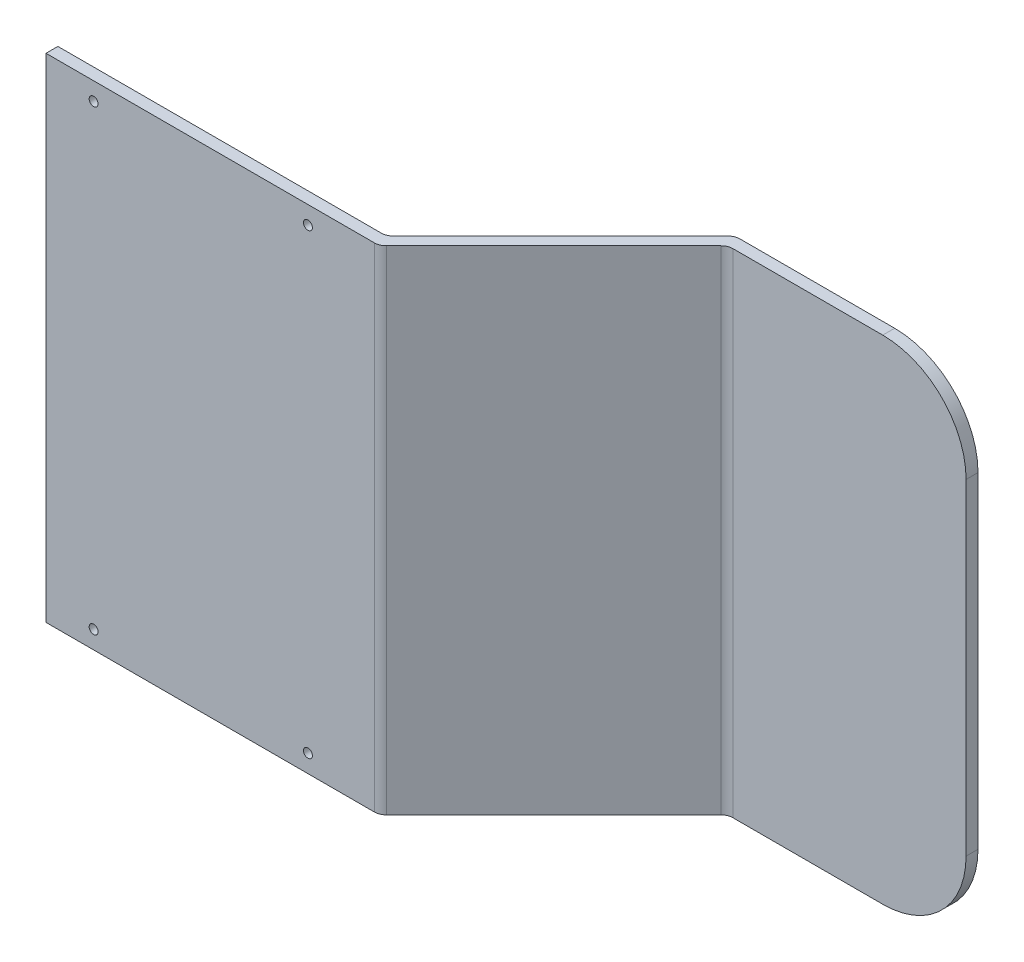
ISO-10303-21;
HEADER;
FILE_DESCRIPTION(('STEP AP214'),'2;1');
FILE_NAME('part.step','',(''),(''),'','','');
FILE_SCHEMA(('AUTOMOTIVE_DESIGN { 1 0 10303 214 1 1 1 1 }'));
ENDSEC;
DATA;
#1=APPLICATION_CONTEXT('core data for automotive mechanical design processes');
#2=APPLICATION_PROTOCOL_DEFINITION('international standard','automotive_design',2000,#1);
#3=PRODUCT_CONTEXT('',#1,'mechanical');
#4=PRODUCT('Part','Part','',(#3));
#5=PRODUCT_RELATED_PRODUCT_CATEGORY('part','',(#4));
#6=PRODUCT_DEFINITION_FORMATION('','',#4);
#7=PRODUCT_DEFINITION_CONTEXT('part definition',#1,'design');
#8=PRODUCT_DEFINITION('design','',#6,#7);
#9=PRODUCT_DEFINITION_SHAPE('','',#8);
#10=(LENGTH_UNIT() NAMED_UNIT(*) SI_UNIT(.MILLI.,.METRE.));
#11=(NAMED_UNIT(*) PLANE_ANGLE_UNIT() SI_UNIT($,.RADIAN.));
#12=(NAMED_UNIT(*) SI_UNIT($,.STERADIAN.) SOLID_ANGLE_UNIT());
#13=UNCERTAINTY_MEASURE_WITH_UNIT(LENGTH_MEASURE(1.E-05),#10,'distance_accuracy_value','');
#14=(GEOMETRIC_REPRESENTATION_CONTEXT(3) GLOBAL_UNCERTAINTY_ASSIGNED_CONTEXT((#13)) GLOBAL_UNIT_ASSIGNED_CONTEXT((#10,
#11,#12)) REPRESENTATION_CONTEXT('',''));
#15=CARTESIAN_POINT('',(0.,0.,0.));
#16=DIRECTION('',(0.,0.,1.));
#17=DIRECTION('',(1.,0.,0.));
#18=AXIS2_PLACEMENT_3D('',#15,#16,#17);
#19=CARTESIAN_POINT('',(0.,-525.78,0.));
#20=DIRECTION('',(-1.,0.,0.));
#21=DIRECTION('',(0.,0.,1.));
#22=AXIS2_PLACEMENT_3D('',#19,#20,#21);
#23=PLANE('',#22);
#24=DIRECTION('',(0.,0.,1.));
#25=VECTOR('',#24,1.);
#26=CARTESIAN_POINT('',(0.,0.,0.));
#27=LINE('',#26,#25);
#28=CARTESIAN_POINT('',(0.,0.,-12.7));
#29=VERTEX_POINT('',#28);
#30=CARTESIAN_POINT('',(0.,0.,0.));
#31=VERTEX_POINT('',#30);
#32=EDGE_CURVE('E180',#29,#31,#27,.T.);
#33=ORIENTED_EDGE('',*,*,#32,.F.);
#34=DIRECTION('',(0.,1.,0.));
#35=VECTOR('',#34,1.);
#36=CARTESIAN_POINT('',(0.,-525.78,-12.7));
#37=LINE('',#36,#35);
#38=CARTESIAN_POINT('',(0.,-525.78,-12.7));
#39=VERTEX_POINT('',#38);
#40=EDGE_CURVE('E161',#39,#29,#37,.T.);
#41=ORIENTED_EDGE('',*,*,#40,.F.);
#42=DIRECTION('',(0.,0.,1.));
#43=VECTOR('',#42,1.);
#44=CARTESIAN_POINT('',(0.,-525.78,0.));
#45=LINE('',#44,#43);
#46=CARTESIAN_POINT('',(0.,-525.78,0.));
#47=VERTEX_POINT('',#46);
#48=EDGE_CURVE('E153',#39,#47,#45,.T.);
#49=ORIENTED_EDGE('',*,*,#48,.T.);
#50=DIRECTION('',(0.,1.,0.));
#51=VECTOR('',#50,1.);
#52=CARTESIAN_POINT('',(0.,-525.78,0.));
#53=LINE('',#52,#51);
#54=EDGE_CURVE('E135',#47,#31,#53,.T.);
#55=ORIENTED_EDGE('',*,*,#54,.T.);
#56=EDGE_LOOP('',(#33,#41,#49,#55));
#57=FACE_BOUND('',#56,.T.);
#58=ADVANCED_FACE('F30',(#57),#23,.T.);
#59=CARTESIAN_POINT('',(350.339487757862,-525.78,-12.7));
#60=DIRECTION('',(0.,0.,-1.));
#61=DIRECTION('',(-1.,0.,0.));
#62=AXIS2_PLACEMENT_3D('',#59,#60,#61);
#63=PLANE('',#62);
#64=CARTESIAN_POINT('',(50.8,-506.73,-12.7));
#65=DIRECTION('',(0.,0.,-1.));
#66=DIRECTION('',(-1.,0.,0.));
#67=AXIS2_PLACEMENT_3D('',#64,#65,#66);
#68=CIRCLE('',#67,4.76249999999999);
#69=CARTESIAN_POINT('',(46.0375,-506.73,-12.7));
#70=VERTEX_POINT('',#69);
#71=EDGE_CURVE('E362',#70,#70,#68,.T.);
#72=ORIENTED_EDGE('',*,*,#71,.F.);
#73=EDGE_LOOP('',(#72));
#74=FACE_BOUND('',#73,.T.);
#75=CARTESIAN_POINT('',(279.4,-506.73,-12.7));
#76=DIRECTION('',(0.,0.,-1.));
#77=DIRECTION('',(-1.,0.,0.));
#78=AXIS2_PLACEMENT_3D('',#75,#76,#77);
#79=CIRCLE('',#78,4.76250000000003);
#80=CARTESIAN_POINT('',(274.6375,-506.73,-12.7));
#81=VERTEX_POINT('',#80);
#82=EDGE_CURVE('E358',#81,#81,#79,.T.);
#83=ORIENTED_EDGE('',*,*,#82,.F.);
#84=EDGE_LOOP('',(#83));
#85=FACE_BOUND('',#84,.T.);
#86=CARTESIAN_POINT('',(279.4,-19.05,-12.7));
#87=DIRECTION('',(0.,0.,-1.));
#88=DIRECTION('',(-1.,0.,0.));
#89=AXIS2_PLACEMENT_3D('',#86,#87,#88);
#90=CIRCLE('',#89,4.76250000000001);
#91=CARTESIAN_POINT('',(274.6375,-19.05,-12.7));
#92=VERTEX_POINT('',#91);
#93=EDGE_CURVE('E352',#92,#92,#90,.T.);
#94=ORIENTED_EDGE('',*,*,#93,.F.);
#95=EDGE_LOOP('',(#94));
#96=FACE_BOUND('',#95,.T.);
#97=CARTESIAN_POINT('',(50.8,-19.05,-12.7));
#98=DIRECTION('',(0.,0.,-1.));
#99=DIRECTION('',(-1.,0.,0.));
#100=AXIS2_PLACEMENT_3D('',#97,#98,#99);
#101=CIRCLE('',#100,4.7625);
#102=CARTESIAN_POINT('',(46.0375,-19.05,-12.7));
#103=VERTEX_POINT('',#102);
#104=EDGE_CURVE('E167',#103,#103,#101,.T.);
#105=ORIENTED_EDGE('',*,*,#104,.F.);
#106=EDGE_LOOP('',(#105));
#107=FACE_BOUND('',#106,.T.);
#108=DIRECTION('',(-1.,0.,0.));
#109=VECTOR('',#108,1.);
#110=CARTESIAN_POINT('',(350.339487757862,0.,-12.7));
#111=LINE('',#110,#109);
#112=CARTESIAN_POINT('',(345.078975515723,0.,-12.7));
#113=VERTEX_POINT('',#112);
#114=EDGE_CURVE('E162',#113,#29,#111,.T.);
#115=ORIENTED_EDGE('',*,*,#114,.F.);
#116=DIRECTION('',(0.,1.,0.));
#117=VECTOR('',#116,1.);
#118=CARTESIAN_POINT('',(345.078975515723,-525.78,-12.7));
#119=LINE('',#118,#117);
#120=CARTESIAN_POINT('',(345.078975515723,-525.78,-12.7));
#121=VERTEX_POINT('',#120);
#122=EDGE_CURVE('E213',#113,#121,#119,.F.);
#123=ORIENTED_EDGE('',*,*,#122,.T.);
#124=DIRECTION('',(-1.,0.,0.));
#125=VECTOR('',#124,1.);
#126=CARTESIAN_POINT('',(350.339487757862,-525.78,-12.7));
#127=LINE('',#126,#125);
#128=EDGE_CURVE('E148',#121,#39,#127,.T.);
#129=ORIENTED_EDGE('',*,*,#128,.T.);
#130=ORIENTED_EDGE('',*,*,#40,.T.);
#131=EDGE_LOOP('',(#115,#123,#129,#130));
#132=FACE_BOUND('',#131,.T.);
#133=ADVANCED_FACE('F278',(#74,#85,#96,#107,#132),#63,.T.);
#134=CARTESIAN_POINT('',(536.267487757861,-525.78,-198.628));
#135=DIRECTION('',(-0.707106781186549,0.,-0.707106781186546));
#136=DIRECTION('',(-0.707106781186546,0.,0.707106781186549));
#137=AXIS2_PLACEMENT_3D('',#134,#135,#136);
#138=PLANE('',#137);
#139=DIRECTION('',(-0.707106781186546,0.,0.707106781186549));
#140=VECTOR('',#139,1.);
#141=CARTESIAN_POINT('',(536.267487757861,0.,-198.628));
#142=LINE('',#141,#140);
#143=CARTESIAN_POINT('',(532.54774387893,0.,-194.908256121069));
#144=VERTEX_POINT('',#143);
#145=CARTESIAN_POINT('',(354.059231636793,0.,-16.4197438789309));
#146=VERTEX_POINT('',#145);
#147=EDGE_CURVE('E164',#144,#146,#142,.T.);
#148=ORIENTED_EDGE('',*,*,#147,.F.);
#149=DIRECTION('',(0.,1.,0.));
#150=VECTOR('',#149,1.);
#151=CARTESIAN_POINT('',(532.54774387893,-525.78,-194.908256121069));
#152=LINE('',#151,#150);
#153=CARTESIAN_POINT('',(532.54774387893,-525.78,-194.908256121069));
#154=VERTEX_POINT('',#153);
#155=EDGE_CURVE('E207',#144,#154,#152,.F.);
#156=ORIENTED_EDGE('',*,*,#155,.T.);
#157=DIRECTION('',(-0.707106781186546,0.,0.707106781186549));
#158=VECTOR('',#157,1.);
#159=CARTESIAN_POINT('',(536.267487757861,-525.78,-198.628));
#160=LINE('',#159,#158);
#161=CARTESIAN_POINT('',(354.059231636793,-525.78,-16.4197438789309));
#162=VERTEX_POINT('',#161);
#163=EDGE_CURVE('E176',#154,#162,#160,.T.);
#164=ORIENTED_EDGE('',*,*,#163,.T.);
#165=DIRECTION('',(0.,1.,0.));
#166=VECTOR('',#165,1.);
#167=CARTESIAN_POINT('',(354.059231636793,0.,-16.4197438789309));
#168=LINE('',#167,#166);
#169=EDGE_CURVE('E204',#162,#146,#168,.T.);
#170=ORIENTED_EDGE('',*,*,#169,.T.);
#171=EDGE_LOOP('',(#148,#156,#164,#170));
#172=FACE_BOUND('',#171,.T.);
#173=ADVANCED_FACE('F283',(#172),#138,.T.);
#174=CARTESIAN_POINT('',(795.527999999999,-525.78,-198.628));
#175=DIRECTION('',(0.,0.,-1.));
#176=DIRECTION('',(-1.,0.,0.));
#177=AXIS2_PLACEMENT_3D('',#174,#175,#176);
#178=PLANE('',#177);
#179=DIRECTION('',(0.,1.,0.));
#180=VECTOR('',#179,1.);
#181=CARTESIAN_POINT('',(795.527999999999,-525.78,-198.628));
#182=LINE('',#181,#180);
#183=CARTESIAN_POINT('',(795.527999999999,-436.88,-198.628));
#184=VERTEX_POINT('',#183);
#185=CARTESIAN_POINT('',(795.527999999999,-88.9,-198.628));
#186=VERTEX_POINT('',#185);
#187=EDGE_CURVE('E194',#184,#186,#182,.T.);
#188=ORIENTED_EDGE('',*,*,#187,.F.);
#189=CARTESIAN_POINT('',(706.627999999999,-436.88,-198.628));
#190=DIRECTION('',(0.,0.,-1.));
#191=DIRECTION('',(-1.,0.,0.));
#192=AXIS2_PLACEMENT_3D('',#189,#190,#191);
#193=CIRCLE('',#192,88.9);
#194=CARTESIAN_POINT('',(706.627999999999,-525.78,-198.628));
#195=VERTEX_POINT('',#194);
#196=EDGE_CURVE('E239',#184,#195,#193,.T.);
#197=ORIENTED_EDGE('',*,*,#196,.T.);
#198=DIRECTION('',(-1.,0.,0.));
#199=VECTOR('',#198,1.);
#200=CARTESIAN_POINT('',(795.527999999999,-525.78,-198.628));
#201=LINE('',#200,#199);
#202=CARTESIAN_POINT('',(541.527999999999,-525.78,-198.628));
#203=VERTEX_POINT('',#202);
#204=EDGE_CURVE('E174',#195,#203,#201,.T.);
#205=ORIENTED_EDGE('',*,*,#204,.T.);
#206=DIRECTION('',(0.,1.,0.));
#207=VECTOR('',#206,1.);
#208=CARTESIAN_POINT('',(541.527999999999,-525.78,-198.628));
#209=LINE('',#208,#207);
#210=CARTESIAN_POINT('',(541.527999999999,0.,-198.628));
#211=VERTEX_POINT('',#210);
#212=EDGE_CURVE('E193',#203,#211,#209,.T.);
#213=ORIENTED_EDGE('',*,*,#212,.T.);
#214=DIRECTION('',(-1.,0.,0.));
#215=VECTOR('',#214,1.);
#216=CARTESIAN_POINT('',(795.527999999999,0.,-198.628));
#217=LINE('',#216,#215);
#218=CARTESIAN_POINT('',(706.627999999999,0.,-198.628));
#219=VERTEX_POINT('',#218);
#220=EDGE_CURVE('E188',#219,#211,#217,.T.);
#221=ORIENTED_EDGE('',*,*,#220,.F.);
#222=CARTESIAN_POINT('',(706.627999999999,-88.9,-198.628));
#223=DIRECTION('',(0.,0.,-1.));
#224=DIRECTION('',(-1.,0.,0.));
#225=AXIS2_PLACEMENT_3D('',#222,#223,#224);
#226=CIRCLE('',#225,88.9);
#227=EDGE_CURVE('E237',#219,#186,#226,.T.);
#228=ORIENTED_EDGE('',*,*,#227,.T.);
#229=EDGE_LOOP('',(#188,#197,#205,#213,#221,#228));
#230=FACE_BOUND('',#229,.T.);
#231=ADVANCED_FACE('F253',(#230),#178,.T.);
#232=CARTESIAN_POINT('',(795.527999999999,-525.78,-185.928));
#233=DIRECTION('',(1.,0.,0.));
#234=DIRECTION('',(0.,0.,-1.));
#235=AXIS2_PLACEMENT_3D('',#232,#233,#234);
#236=PLANE('',#235);
#237=DIRECTION('',(0.,1.,0.));
#238=VECTOR('',#237,1.);
#239=CARTESIAN_POINT('',(795.527999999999,-525.78,-185.928));
#240=LINE('',#239,#238);
#241=CARTESIAN_POINT('',(795.527999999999,-436.88,-185.928));
#242=VERTEX_POINT('',#241);
#243=CARTESIAN_POINT('',(795.527999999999,-88.9,-185.928));
#244=VERTEX_POINT('',#243);
#245=EDGE_CURVE('E147',#242,#244,#240,.T.);
#246=ORIENTED_EDGE('',*,*,#245,.F.);
#247=DIRECTION('',(0.,0.,-1.));
#248=VECTOR('',#247,1.);
#249=CARTESIAN_POINT('',(795.527999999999,-436.88,-198.628));
#250=LINE('',#249,#248);
#251=EDGE_CURVE('E234',#242,#184,#250,.T.);
#252=ORIENTED_EDGE('',*,*,#251,.T.);
#253=ORIENTED_EDGE('',*,*,#187,.T.);
#254=DIRECTION('',(0.,0.,-1.));
#255=VECTOR('',#254,1.);
#256=CARTESIAN_POINT('',(795.527999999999,-88.9,-185.928));
#257=LINE('',#256,#255);
#258=EDGE_CURVE('E232',#186,#244,#257,.F.);
#259=ORIENTED_EDGE('',*,*,#258,.T.);
#260=EDGE_LOOP('',(#246,#252,#253,#259));
#261=FACE_BOUND('',#260,.T.);
#262=ADVANCED_FACE('F248',(#261),#236,.T.);
#263=CARTESIAN_POINT('',(541.527999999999,-525.78,-185.928));
#264=DIRECTION('',(0.,0.,1.));
#265=DIRECTION('',(1.,0.,0.));
#266=AXIS2_PLACEMENT_3D('',#263,#264,#265);
#267=PLANE('',#266);
#268=DIRECTION('',(1.,0.,0.));
#269=VECTOR('',#268,1.);
#270=CARTESIAN_POINT('',(541.527999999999,-525.78,-185.928));
#271=LINE('',#270,#269);
#272=CARTESIAN_POINT('',(546.788512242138,-525.78,-185.928));
#273=VERTEX_POINT('',#272);
#274=CARTESIAN_POINT('',(706.627999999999,-525.78,-185.928));
#275=VERTEX_POINT('',#274);
#276=EDGE_CURVE('E172',#273,#275,#271,.T.);
#277=ORIENTED_EDGE('',*,*,#276,.T.);
#278=CARTESIAN_POINT('',(706.627999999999,-436.88,-185.928));
#279=DIRECTION('',(0.,0.,1.));
#280=DIRECTION('',(1.,0.,0.));
#281=AXIS2_PLACEMENT_3D('',#278,#279,#280);
#282=CIRCLE('',#281,88.9);
#283=EDGE_CURVE('E38',#275,#242,#282,.T.);
#284=ORIENTED_EDGE('',*,*,#283,.T.);
#285=ORIENTED_EDGE('',*,*,#245,.T.);
#286=CARTESIAN_POINT('',(706.627999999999,-88.9,-185.928));
#287=DIRECTION('',(0.,0.,1.));
#288=DIRECTION('',(1.,0.,0.));
#289=AXIS2_PLACEMENT_3D('',#286,#287,#288);
#290=CIRCLE('',#289,88.9);
#291=CARTESIAN_POINT('',(706.627999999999,0.,-185.928));
#292=VERTEX_POINT('',#291);
#293=EDGE_CURVE('E45',#244,#292,#290,.T.);
#294=ORIENTED_EDGE('',*,*,#293,.T.);
#295=DIRECTION('',(1.,0.,0.));
#296=VECTOR('',#295,1.);
#297=CARTESIAN_POINT('',(541.527999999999,0.,-185.928));
#298=LINE('',#297,#296);
#299=CARTESIAN_POINT('',(546.788512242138,0.,-185.928));
#300=VERTEX_POINT('',#299);
#301=EDGE_CURVE('E186',#300,#292,#298,.T.);
#302=ORIENTED_EDGE('',*,*,#301,.F.);
#303=DIRECTION('',(0.,1.,0.));
#304=VECTOR('',#303,1.);
#305=CARTESIAN_POINT('',(546.788512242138,-525.78,-185.928));
#306=LINE('',#305,#304);
#307=EDGE_CURVE('E220',#300,#273,#306,.F.);
#308=ORIENTED_EDGE('',*,*,#307,.T.);
#309=EDGE_LOOP('',(#277,#284,#285,#294,#302,#308));
#310=FACE_BOUND('',#309,.T.);
#311=ADVANCED_FACE('F244',(#310),#267,.T.);
#312=CARTESIAN_POINT('',(355.6,-525.78,0.));
#313=DIRECTION('',(0.707106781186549,0.,0.707106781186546));
#314=DIRECTION('',(0.707106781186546,0.,-0.707106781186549));
#315=AXIS2_PLACEMENT_3D('',#312,#313,#314);
#316=PLANE('',#315);
#317=DIRECTION('',(0.707106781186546,0.,-0.707106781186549));
#318=VECTOR('',#317,1.);
#319=CARTESIAN_POINT('',(355.6,-525.78,0.));
#320=LINE('',#319,#318);
#321=CARTESIAN_POINT('',(359.319743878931,-525.78,-3.71974387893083));
#322=VERTEX_POINT('',#321);
#323=CARTESIAN_POINT('',(537.808256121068,-525.78,-182.208256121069));
#324=VERTEX_POINT('',#323);
#325=EDGE_CURVE('E157',#322,#324,#320,.T.);
#326=ORIENTED_EDGE('',*,*,#325,.T.);
#327=DIRECTION('',(0.,1.,0.));
#328=VECTOR('',#327,1.);
#329=CARTESIAN_POINT('',(537.808256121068,0.,-182.208256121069));
#330=LINE('',#329,#328);
#331=CARTESIAN_POINT('',(537.808256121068,0.,-182.208256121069));
#332=VERTEX_POINT('',#331);
#333=EDGE_CURVE('E217',#324,#332,#330,.T.);
#334=ORIENTED_EDGE('',*,*,#333,.T.);
#335=DIRECTION('',(0.707106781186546,0.,-0.707106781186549));
#336=VECTOR('',#335,1.);
#337=CARTESIAN_POINT('',(355.6,0.,0.));
#338=LINE('',#337,#336);
#339=CARTESIAN_POINT('',(359.319743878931,0.,-3.71974387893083));
#340=VERTEX_POINT('',#339);
#341=EDGE_CURVE('E183',#340,#332,#338,.T.);
#342=ORIENTED_EDGE('',*,*,#341,.F.);
#343=DIRECTION('',(0.,1.,0.));
#344=VECTOR('',#343,1.);
#345=CARTESIAN_POINT('',(359.319743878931,-525.78,-3.71974387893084));
#346=LINE('',#345,#344);
#347=EDGE_CURVE('E215',#340,#322,#346,.F.);
#348=ORIENTED_EDGE('',*,*,#347,.T.);
#349=EDGE_LOOP('',(#326,#334,#342,#348));
#350=FACE_BOUND('',#349,.T.);
#351=ADVANCED_FACE('F322',(#350),#316,.T.);
#352=CARTESIAN_POINT('',(0.,-525.78,0.));
#353=DIRECTION('',(0.,0.,1.));
#354=DIRECTION('',(1.,0.,0.));
#355=AXIS2_PLACEMENT_3D('',#352,#353,#354);
#356=PLANE('',#355);
#357=CARTESIAN_POINT('',(50.8,-506.73,0.));
#358=DIRECTION('',(0.,0.,1.));
#359=DIRECTION('',(-1.,0.,0.));
#360=AXIS2_PLACEMENT_3D('',#357,#358,#359);
#361=CIRCLE('',#360,4.76249999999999);
#362=CARTESIAN_POINT('',(46.0375,-506.73,0.));
#363=VERTEX_POINT('',#362);
#364=EDGE_CURVE('E339',#363,#363,#361,.T.);
#365=ORIENTED_EDGE('',*,*,#364,.F.);
#366=EDGE_LOOP('',(#365));
#367=FACE_BOUND('',#366,.T.);
#368=CARTESIAN_POINT('',(279.4,-506.73,0.));
#369=DIRECTION('',(0.,0.,1.));
#370=DIRECTION('',(-1.,0.,0.));
#371=AXIS2_PLACEMENT_3D('',#368,#369,#370);
#372=CIRCLE('',#371,4.76250000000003);
#373=CARTESIAN_POINT('',(274.6375,-506.73,0.));
#374=VERTEX_POINT('',#373);
#375=EDGE_CURVE('E343',#374,#374,#372,.T.);
#376=ORIENTED_EDGE('',*,*,#375,.F.);
#377=EDGE_LOOP('',(#376));
#378=FACE_BOUND('',#377,.T.);
#379=CARTESIAN_POINT('',(279.4,-19.05,0.));
#380=DIRECTION('',(0.,0.,1.));
#381=DIRECTION('',(1.,0.,0.));
#382=AXIS2_PLACEMENT_3D('',#379,#380,#381);
#383=CIRCLE('',#382,4.76250000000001);
#384=CARTESIAN_POINT('',(284.1625,-19.05,0.));
#385=VERTEX_POINT('',#384);
#386=EDGE_CURVE('E347',#385,#385,#383,.T.);
#387=ORIENTED_EDGE('',*,*,#386,.F.);
#388=EDGE_LOOP('',(#387));
#389=FACE_BOUND('',#388,.T.);
#390=CARTESIAN_POINT('',(50.8,-19.05,0.));
#391=DIRECTION('',(0.,0.,1.));
#392=DIRECTION('',(1.,0.,0.));
#393=AXIS2_PLACEMENT_3D('',#390,#391,#392);
#394=CIRCLE('',#393,4.7625);
#395=CARTESIAN_POINT('',(55.5625,-19.05,0.));
#396=VERTEX_POINT('',#395);
#397=EDGE_CURVE('E350',#396,#396,#394,.T.);
#398=ORIENTED_EDGE('',*,*,#397,.F.);
#399=EDGE_LOOP('',(#398));
#400=FACE_BOUND('',#399,.T.);
#401=DIRECTION('',(1.,0.,0.));
#402=VECTOR('',#401,1.);
#403=CARTESIAN_POINT('',(0.,-525.78,0.));
#404=LINE('',#403,#402);
#405=CARTESIAN_POINT('',(350.339487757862,-525.78,0.));
#406=VERTEX_POINT('',#405);
#407=EDGE_CURVE('E139',#47,#406,#404,.T.);
#408=ORIENTED_EDGE('',*,*,#407,.T.);
#409=DIRECTION('',(0.,1.,0.));
#410=VECTOR('',#409,1.);
#411=CARTESIAN_POINT('',(350.339487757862,-525.78,0.));
#412=LINE('',#411,#410);
#413=CARTESIAN_POINT('',(350.339487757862,0.,0.));
#414=VERTEX_POINT('',#413);
#415=EDGE_CURVE('E222',#406,#414,#412,.T.);
#416=ORIENTED_EDGE('',*,*,#415,.T.);
#417=DIRECTION('',(1.,0.,0.));
#418=VECTOR('',#417,1.);
#419=CARTESIAN_POINT('',(0.,0.,0.));
#420=LINE('',#419,#418);
#421=EDGE_CURVE('E142',#31,#414,#420,.T.);
#422=ORIENTED_EDGE('',*,*,#421,.F.);
#423=ORIENTED_EDGE('',*,*,#54,.F.);
#424=EDGE_LOOP('',(#408,#416,#422,#423));
#425=FACE_BOUND('',#424,.T.);
#426=ADVANCED_FACE('F137',(#367,#378,#389,#400,#425),#356,.T.);
#427=CARTESIAN_POINT('',(0.,-525.78,-12.7));
#428=DIRECTION('',(0.,1.,0.));
#429=DIRECTION('',(0.,0.,1.));
#430=AXIS2_PLACEMENT_3D('',#427,#428,#429);
#431=PLANE('',#430);
#432=ORIENTED_EDGE('',*,*,#204,.F.);
#433=DIRECTION('',(0.,0.,-1.));
#434=VECTOR('',#433,1.);
#435=CARTESIAN_POINT('',(706.627999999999,-525.78,-185.928));
#436=LINE('',#435,#434);
#437=EDGE_CURVE('E53',#195,#275,#436,.F.);
#438=ORIENTED_EDGE('',*,*,#437,.T.);
#439=ORIENTED_EDGE('',*,*,#276,.F.);
#440=CARTESIAN_POINT('',(546.788512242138,-525.78,-173.228));
#441=DIRECTION('',(0.,1.,0.));
#442=DIRECTION('',(0.,0.,1.));
#443=AXIS2_PLACEMENT_3D('',#440,#441,#442);
#444=CIRCLE('',#443,12.7);
#445=EDGE_CURVE('E230',#273,#324,#444,.T.);
#446=ORIENTED_EDGE('',*,*,#445,.T.);
#447=ORIENTED_EDGE('',*,*,#325,.F.);
#448=CARTESIAN_POINT('',(350.339487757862,-525.78,-12.7));
#449=DIRECTION('',(0.,1.,0.));
#450=DIRECTION('',(0.,0.,1.));
#451=AXIS2_PLACEMENT_3D('',#448,#449,#450);
#452=CIRCLE('',#451,12.7);
#453=EDGE_CURVE('E156',#322,#406,#452,.F.);
#454=ORIENTED_EDGE('',*,*,#453,.T.);
#455=ORIENTED_EDGE('',*,*,#407,.F.);
#456=ORIENTED_EDGE('',*,*,#48,.F.);
#457=ORIENTED_EDGE('',*,*,#128,.F.);
#458=CARTESIAN_POINT('',(345.078975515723,-525.78,-25.4));
#459=DIRECTION('',(0.,1.,0.));
#460=DIRECTION('',(0.,0.,1.));
#461=AXIS2_PLACEMENT_3D('',#458,#459,#460);
#462=CIRCLE('',#461,12.7);
#463=EDGE_CURVE('E226',#121,#162,#462,.T.);
#464=ORIENTED_EDGE('',*,*,#463,.T.);
#465=ORIENTED_EDGE('',*,*,#163,.F.);
#466=CARTESIAN_POINT('',(541.527999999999,-525.78,-185.928));
#467=DIRECTION('',(0.,1.,0.));
#468=DIRECTION('',(0.,0.,1.));
#469=AXIS2_PLACEMENT_3D('',#466,#467,#468);
#470=CIRCLE('',#469,12.7);
#471=EDGE_CURVE('E210',#154,#203,#470,.F.);
#472=ORIENTED_EDGE('',*,*,#471,.T.);
#473=EDGE_LOOP('',(#432,#438,#439,#446,#447,#454,#455,#456,#457,#464,#465,#472));
#474=FACE_BOUND('',#473,.T.);
#475=ADVANCED_FACE('F151',(#474),#431,.F.);
#476=CARTESIAN_POINT('',(0.,0.,-12.7));
#477=DIRECTION('',(0.,1.,0.));
#478=DIRECTION('',(0.,0.,1.));
#479=AXIS2_PLACEMENT_3D('',#476,#477,#478);
#480=PLANE('',#479);
#481=ORIENTED_EDGE('',*,*,#301,.T.);
#482=DIRECTION('',(0.,0.,-1.));
#483=VECTOR('',#482,1.);
#484=CARTESIAN_POINT('',(706.627999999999,0.,-12.7));
#485=LINE('',#484,#483);
#486=EDGE_CURVE('E11',#292,#219,#485,.T.);
#487=ORIENTED_EDGE('',*,*,#486,.T.);
#488=ORIENTED_EDGE('',*,*,#220,.T.);
#489=CARTESIAN_POINT('',(541.527999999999,0.,-185.928));
#490=DIRECTION('',(0.,1.,0.));
#491=DIRECTION('',(0.,0.,1.));
#492=AXIS2_PLACEMENT_3D('',#489,#490,#491);
#493=CIRCLE('',#492,12.7);
#494=EDGE_CURVE('E202',#211,#144,#493,.T.);
#495=ORIENTED_EDGE('',*,*,#494,.T.);
#496=ORIENTED_EDGE('',*,*,#147,.T.);
#497=CARTESIAN_POINT('',(345.078975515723,0.,-25.4));
#498=DIRECTION('',(0.,1.,0.));
#499=DIRECTION('',(0.,0.,1.));
#500=AXIS2_PLACEMENT_3D('',#497,#498,#499);
#501=CIRCLE('',#500,12.7);
#502=EDGE_CURVE('E224',#146,#113,#501,.F.);
#503=ORIENTED_EDGE('',*,*,#502,.T.);
#504=ORIENTED_EDGE('',*,*,#114,.T.);
#505=ORIENTED_EDGE('',*,*,#32,.T.);
#506=ORIENTED_EDGE('',*,*,#421,.T.);
#507=CARTESIAN_POINT('',(350.339487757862,0.,-12.7));
#508=DIRECTION('',(0.,1.,0.));
#509=DIRECTION('',(0.,0.,1.));
#510=AXIS2_PLACEMENT_3D('',#507,#508,#509);
#511=CIRCLE('',#510,12.7);
#512=EDGE_CURVE('E200',#414,#340,#511,.T.);
#513=ORIENTED_EDGE('',*,*,#512,.T.);
#514=ORIENTED_EDGE('',*,*,#341,.T.);
#515=CARTESIAN_POINT('',(546.788512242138,0.,-173.228));
#516=DIRECTION('',(0.,1.,0.));
#517=DIRECTION('',(0.,0.,1.));
#518=AXIS2_PLACEMENT_3D('',#515,#516,#517);
#519=CIRCLE('',#518,12.7);
#520=EDGE_CURVE('E228',#332,#300,#519,.F.);
#521=ORIENTED_EDGE('',*,*,#520,.T.);
#522=EDGE_LOOP('',(#481,#487,#488,#495,#496,#503,#504,#505,#506,#513,#514,#521));
#523=FACE_BOUND('',#522,.T.);
#524=ADVANCED_FACE('F263',(#523),#480,.T.);
#525=CARTESIAN_POINT('',(541.527999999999,-525.78,-185.928));
#526=DIRECTION('',(0.,1.,0.));
#527=DIRECTION('',(0.,0.,1.));
#528=AXIS2_PLACEMENT_3D('',#525,#526,#527);
#529=CYLINDRICAL_SURFACE('',#528,12.7);
#530=ORIENTED_EDGE('',*,*,#471,.F.);
#531=ORIENTED_EDGE('',*,*,#155,.F.);
#532=ORIENTED_EDGE('',*,*,#494,.F.);
#533=ORIENTED_EDGE('',*,*,#212,.F.);
#534=EDGE_LOOP('',(#530,#531,#532,#533));
#535=FACE_BOUND('',#534,.T.);
#536=ADVANCED_FACE('F260',(#535),#529,.T.);
#537=CARTESIAN_POINT('',(345.078975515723,-525.78,-25.4));
#538=DIRECTION('',(0.,-1.,0.));
#539=DIRECTION('',(0.,0.,-1.));
#540=AXIS2_PLACEMENT_3D('',#537,#538,#539);
#541=CYLINDRICAL_SURFACE('',#540,12.7);
#542=ORIENTED_EDGE('',*,*,#463,.F.);
#543=ORIENTED_EDGE('',*,*,#122,.F.);
#544=ORIENTED_EDGE('',*,*,#502,.F.);
#545=ORIENTED_EDGE('',*,*,#169,.F.);
#546=EDGE_LOOP('',(#542,#543,#544,#545));
#547=FACE_BOUND('',#546,.T.);
#548=ADVANCED_FACE('F291',(#547),#541,.F.);
#549=CARTESIAN_POINT('',(546.788512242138,-525.78,-173.228));
#550=DIRECTION('',(0.,-1.,0.));
#551=DIRECTION('',(0.,0.,-1.));
#552=AXIS2_PLACEMENT_3D('',#549,#550,#551);
#553=CYLINDRICAL_SURFACE('',#552,12.7);
#554=ORIENTED_EDGE('',*,*,#445,.F.);
#555=ORIENTED_EDGE('',*,*,#307,.F.);
#556=ORIENTED_EDGE('',*,*,#520,.F.);
#557=ORIENTED_EDGE('',*,*,#333,.F.);
#558=EDGE_LOOP('',(#554,#555,#556,#557));
#559=FACE_BOUND('',#558,.T.);
#560=ADVANCED_FACE('F294',(#559),#553,.F.);
#561=CARTESIAN_POINT('',(350.339487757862,-525.78,-12.7));
#562=DIRECTION('',(0.,1.,0.));
#563=DIRECTION('',(0.,0.,1.));
#564=AXIS2_PLACEMENT_3D('',#561,#562,#563);
#565=CYLINDRICAL_SURFACE('',#564,12.7);
#566=ORIENTED_EDGE('',*,*,#453,.F.);
#567=ORIENTED_EDGE('',*,*,#347,.F.);
#568=ORIENTED_EDGE('',*,*,#512,.F.);
#569=ORIENTED_EDGE('',*,*,#415,.F.);
#570=EDGE_LOOP('',(#566,#567,#568,#569));
#571=FACE_BOUND('',#570,.T.);
#572=ADVANCED_FACE('F276',(#571),#565,.T.);
#573=CARTESIAN_POINT('',(706.627999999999,-436.88,-185.928));
#574=DIRECTION('',(0.,0.,1.));
#575=DIRECTION('',(1.,0.,0.));
#576=AXIS2_PLACEMENT_3D('',#573,#574,#575);
#577=CYLINDRICAL_SURFACE('',#576,88.9);
#578=ORIENTED_EDGE('',*,*,#283,.F.);
#579=ORIENTED_EDGE('',*,*,#437,.F.);
#580=ORIENTED_EDGE('',*,*,#196,.F.);
#581=ORIENTED_EDGE('',*,*,#251,.F.);
#582=EDGE_LOOP('',(#578,#579,#580,#581));
#583=FACE_BOUND('',#582,.T.);
#584=ADVANCED_FACE('F251',(#583),#577,.T.);
#585=CARTESIAN_POINT('',(706.627999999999,-88.9,-12.7));
#586=DIRECTION('',(0.,0.,-1.));
#587=DIRECTION('',(-1.,0.,0.));
#588=AXIS2_PLACEMENT_3D('',#585,#586,#587);
#589=CYLINDRICAL_SURFACE('',#588,88.9);
#590=ORIENTED_EDGE('',*,*,#293,.F.);
#591=ORIENTED_EDGE('',*,*,#258,.F.);
#592=ORIENTED_EDGE('',*,*,#227,.F.);
#593=ORIENTED_EDGE('',*,*,#486,.F.);
#594=EDGE_LOOP('',(#590,#591,#592,#593));
#595=FACE_BOUND('',#594,.T.);
#596=ADVANCED_FACE('F32',(#595),#589,.T.);
#597=CARTESIAN_POINT('',(50.8,-19.05,-198.628));
#598=DIRECTION('',(0.,0.,1.));
#599=DIRECTION('',(1.,0.,0.));
#600=AXIS2_PLACEMENT_3D('',#597,#598,#599);
#601=CYLINDRICAL_SURFACE('',#600,4.7625);
#602=ORIENTED_EDGE('',*,*,#104,.T.);
#603=EDGE_LOOP('',(#602));
#604=FACE_BOUND('',#603,.T.);
#605=ORIENTED_EDGE('',*,*,#397,.T.);
#606=EDGE_LOOP('',(#605));
#607=FACE_BOUND('',#606,.T.);
#608=ADVANCED_FACE('F268',(#604,#607),#601,.F.);
#609=CARTESIAN_POINT('',(279.4,-19.05,-198.628));
#610=DIRECTION('',(0.,0.,1.));
#611=DIRECTION('',(1.,0.,0.));
#612=AXIS2_PLACEMENT_3D('',#609,#610,#611);
#613=CYLINDRICAL_SURFACE('',#612,4.76250000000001);
#614=ORIENTED_EDGE('',*,*,#93,.T.);
#615=EDGE_LOOP('',(#614));
#616=FACE_BOUND('',#615,.T.);
#617=ORIENTED_EDGE('',*,*,#386,.T.);
#618=EDGE_LOOP('',(#617));
#619=FACE_BOUND('',#618,.T.);
#620=ADVANCED_FACE('F273',(#616,#619),#613,.F.);
#621=CARTESIAN_POINT('',(279.4,-506.73,-198.628));
#622=DIRECTION('',(0.,0.,1.));
#623=DIRECTION('',(1.,0.,0.));
#624=AXIS2_PLACEMENT_3D('',#621,#622,#623);
#625=CYLINDRICAL_SURFACE('',#624,4.76250000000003);
#626=ORIENTED_EDGE('',*,*,#82,.T.);
#627=EDGE_LOOP('',(#626));
#628=FACE_BOUND('',#627,.T.);
#629=ORIENTED_EDGE('',*,*,#375,.T.);
#630=EDGE_LOOP('',(#629));
#631=FACE_BOUND('',#630,.T.);
#632=ADVANCED_FACE('F368',(#628,#631),#625,.F.);
#633=CARTESIAN_POINT('',(50.8,-506.73,-198.628));
#634=DIRECTION('',(0.,0.,1.));
#635=DIRECTION('',(1.,0.,0.));
#636=AXIS2_PLACEMENT_3D('',#633,#634,#635);
#637=CYLINDRICAL_SURFACE('',#636,4.76249999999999);
#638=ORIENTED_EDGE('',*,*,#71,.T.);
#639=EDGE_LOOP('',(#638));
#640=FACE_BOUND('',#639,.T.);
#641=ORIENTED_EDGE('',*,*,#364,.T.);
#642=EDGE_LOOP('',(#641));
#643=FACE_BOUND('',#642,.T.);
#644=ADVANCED_FACE('F366',(#640,#643),#637,.F.);
#645=CLOSED_SHELL('',(#58,#133,#173,#231,#262,#311,#351,#426,#475,#524,#536,#548,#560,#572,#584,
#596,#608,#620,#632,#644));
#646=MANIFOLD_SOLID_BREP('B2',#645);
#647=ADVANCED_BREP_SHAPE_REPRESENTATION('',(#18,#646),#14);
#648=SHAPE_DEFINITION_REPRESENTATION(#9,#647);
ENDSEC;
END-ISO-10303-21;
